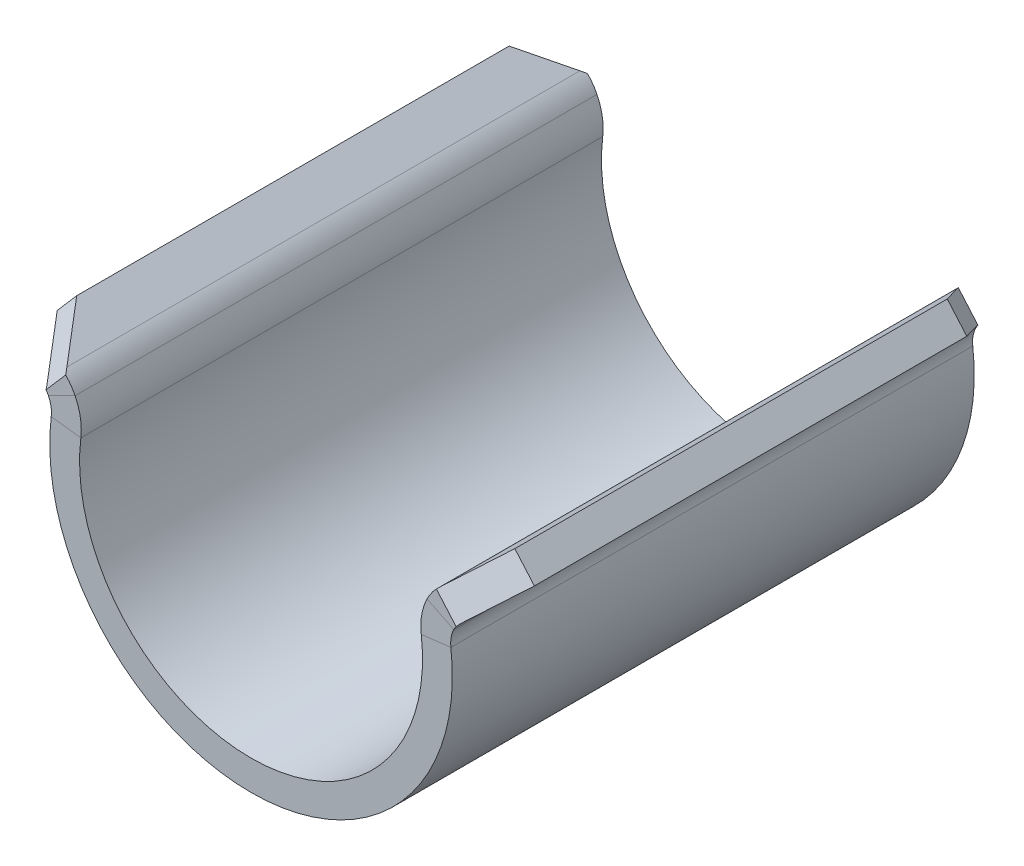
ISO-10303-21;
HEADER;
FILE_DESCRIPTION(('STEP AP214'),'2;1');
FILE_NAME('part.step','',(''),(''),'','','');
FILE_SCHEMA(('AUTOMOTIVE_DESIGN { 1 0 10303 214 1 1 1 1 }'));
ENDSEC;
DATA;
#1=APPLICATION_CONTEXT('core data for automotive mechanical design processes');
#2=APPLICATION_PROTOCOL_DEFINITION('international standard','automotive_design',2000,#1);
#3=PRODUCT_CONTEXT('',#1,'mechanical');
#4=PRODUCT('Part','Part','',(#3));
#5=PRODUCT_RELATED_PRODUCT_CATEGORY('part','',(#4));
#6=PRODUCT_DEFINITION_FORMATION('','',#4);
#7=PRODUCT_DEFINITION_CONTEXT('part definition',#1,'design');
#8=PRODUCT_DEFINITION('design','',#6,#7);
#9=PRODUCT_DEFINITION_SHAPE('','',#8);
#10=(LENGTH_UNIT() NAMED_UNIT(*) SI_UNIT(.MILLI.,.METRE.));
#11=(NAMED_UNIT(*) PLANE_ANGLE_UNIT() SI_UNIT($,.RADIAN.));
#12=(NAMED_UNIT(*) SI_UNIT($,.STERADIAN.) SOLID_ANGLE_UNIT());
#13=UNCERTAINTY_MEASURE_WITH_UNIT(LENGTH_MEASURE(1.E-05),#10,'distance_accuracy_value','');
#14=(GEOMETRIC_REPRESENTATION_CONTEXT(3) GLOBAL_UNCERTAINTY_ASSIGNED_CONTEXT((#13)) GLOBAL_UNIT_ASSIGNED_CONTEXT((#10,
#11,#12)) REPRESENTATION_CONTEXT('',''));
#15=CARTESIAN_POINT('',(0.,0.,0.));
#16=DIRECTION('',(0.,0.,1.));
#17=DIRECTION('',(1.,0.,0.));
#18=AXIS2_PLACEMENT_3D('',#15,#16,#17);
#19=CARTESIAN_POINT('',(11.4155984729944,5.64072337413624,35.));
#20=DIRECTION('',(0.,0.,1.));
#21=DIRECTION('',(1.,0.,0.));
#22=AXIS2_PLACEMENT_3D('',#19,#20,#21);
#23=PLANE('',#22);
#24=DIRECTION('',(0.992660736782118,0.120932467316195,0.));
#25=VECTOR('',#24,1.);
#26=CARTESIAN_POINT('',(11.4155984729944,5.64072337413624,35.));
#27=LINE('',#26,#25);
#28=CARTESIAN_POINT('',(11.4155984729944,5.64072337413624,35.));
#29=VERTEX_POINT('',#28);
#30=CARTESIAN_POINT('',(13.4009199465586,5.88258830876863,35.));
#31=VERTEX_POINT('',#30);
#32=EDGE_CURVE('E357',#29,#31,#27,.T.);
#33=ORIENTED_EDGE('',*,*,#32,.F.);
#34=CARTESIAN_POINT('',(0.,4.25,35.));
#35=DIRECTION('',(0.,0.,1.));
#36=DIRECTION('',(1.,0.,0.));
#37=AXIS2_PLACEMENT_3D('',#34,#35,#36);
#38=CIRCLE('',#37,11.5);
#39=CARTESIAN_POINT('',(-11.4155984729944,5.64072337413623,35.));
#40=VERTEX_POINT('',#39);
#41=EDGE_CURVE('E221',#40,#29,#38,.T.);
#42=ORIENTED_EDGE('',*,*,#41,.F.);
#43=DIRECTION('',(-0.992660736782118,0.120932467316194,0.));
#44=VECTOR('',#43,1.);
#45=CARTESIAN_POINT('',(-11.4155984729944,5.64072337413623,35.));
#46=LINE('',#45,#44);
#47=CARTESIAN_POINT('',(-13.4009199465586,5.88258830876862,35.));
#48=VERTEX_POINT('',#47);
#49=EDGE_CURVE('E351',#40,#48,#46,.T.);
#50=ORIENTED_EDGE('',*,*,#49,.T.);
#51=CARTESIAN_POINT('',(0.,4.25,35.));
#52=DIRECTION('',(0.,0.,1.));
#53=DIRECTION('',(1.,0.,0.));
#54=AXIS2_PLACEMENT_3D('',#51,#52,#53);
#55=CIRCLE('',#54,13.5);
#56=EDGE_CURVE('E242',#48,#31,#55,.T.);
#57=ORIENTED_EDGE('',*,*,#56,.T.);
#58=EDGE_LOOP('',(#33,#42,#50,#57));
#59=FACE_BOUND('',#58,.T.);
#60=ADVANCED_FACE('F44',(#59),#23,.T.);
#61=CARTESIAN_POINT('',(13.4009199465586,5.88258830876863,0.));
#62=DIRECTION('',(0.,0.,-1.));
#63=DIRECTION('',(-1.,0.,0.));
#64=AXIS2_PLACEMENT_3D('',#61,#62,#63);
#65=PLANE('',#64);
#66=DIRECTION('',(-0.992660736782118,-0.120932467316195,0.));
#67=VECTOR('',#66,1.);
#68=CARTESIAN_POINT('',(13.4009199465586,5.88258830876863,0.));
#69=LINE('',#68,#67);
#70=CARTESIAN_POINT('',(13.4009199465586,5.88258830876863,0.));
#71=VERTEX_POINT('',#70);
#72=CARTESIAN_POINT('',(11.4155984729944,5.64072337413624,0.));
#73=VERTEX_POINT('',#72);
#74=EDGE_CURVE('E354',#71,#73,#69,.T.);
#75=ORIENTED_EDGE('',*,*,#74,.F.);
#76=CARTESIAN_POINT('',(0.,4.25,0.));
#77=DIRECTION('',(0.,0.,1.));
#78=DIRECTION('',(1.,0.,0.));
#79=AXIS2_PLACEMENT_3D('',#76,#77,#78);
#80=CIRCLE('',#79,13.5);
#81=CARTESIAN_POINT('',(-13.4009199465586,5.88258830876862,0.));
#82=VERTEX_POINT('',#81);
#83=EDGE_CURVE('E274',#82,#71,#80,.T.);
#84=ORIENTED_EDGE('',*,*,#83,.F.);
#85=DIRECTION('',(0.992660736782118,-0.120932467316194,0.));
#86=VECTOR('',#85,1.);
#87=CARTESIAN_POINT('',(-13.4009199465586,5.88258830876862,0.));
#88=LINE('',#87,#86);
#89=CARTESIAN_POINT('',(-11.4155984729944,5.64072337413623,0.));
#90=VERTEX_POINT('',#89);
#91=EDGE_CURVE('E194',#82,#90,#88,.T.);
#92=ORIENTED_EDGE('',*,*,#91,.T.);
#93=CARTESIAN_POINT('',(0.,4.25,0.));
#94=DIRECTION('',(0.,0.,1.));
#95=DIRECTION('',(1.,0.,0.));
#96=AXIS2_PLACEMENT_3D('',#93,#94,#95);
#97=CIRCLE('',#96,11.5);
#98=EDGE_CURVE('E257',#90,#73,#97,.T.);
#99=ORIENTED_EDGE('',*,*,#98,.T.);
#100=EDGE_LOOP('',(#75,#84,#92,#99));
#101=FACE_BOUND('',#100,.T.);
#102=ADVANCED_FACE('F461',(#101),#65,.T.);
#103=CARTESIAN_POINT('',(-11.4155984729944,5.64072337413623,35.));
#104=DIRECTION('',(0.,0.,1.));
#105=DIRECTION('',(1.,0.,0.));
#106=AXIS2_PLACEMENT_3D('',#103,#104,#105);
#107=PLANE('',#106);
#108=ORIENTED_EDGE('',*,*,#49,.F.);
#109=CARTESIAN_POINT('',(-15.3862414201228,6.12445324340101,35.));
#110=DIRECTION('',(0.,0.,1.));
#111=DIRECTION('',(1.,0.,0.));
#112=AXIS2_PLACEMENT_3D('',#109,#110,#111);
#113=CIRCLE('',#112,4.);
#114=CARTESIAN_POINT('',(-11.7996687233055,7.89546885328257,35.));
#115=VERTEX_POINT('',#114);
#116=EDGE_CURVE('E226',#115,#40,#113,.F.);
#117=ORIENTED_EDGE('',*,*,#116,.F.);
#118=DIRECTION('',(-0.896643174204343,-0.442753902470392,0.));
#119=VECTOR('',#118,1.);
#120=CARTESIAN_POINT('',(-11.7996687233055,7.89546885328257,35.));
#121=LINE('',#120,#119);
#122=CARTESIAN_POINT('',(-13.5929550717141,7.00996104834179,35.));
#123=VERTEX_POINT('',#122);
#124=EDGE_CURVE('E343',#115,#123,#121,.T.);
#125=ORIENTED_EDGE('',*,*,#124,.T.);
#126=CARTESIAN_POINT('',(-15.3862414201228,6.12445324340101,35.));
#127=DIRECTION('',(0.,0.,-1.));
#128=DIRECTION('',(1.,0.,0.));
#129=AXIS2_PLACEMENT_3D('',#126,#127,#128);
#130=CIRCLE('',#129,2.);
#131=EDGE_CURVE('E238',#123,#48,#130,.T.);
#132=ORIENTED_EDGE('',*,*,#131,.T.);
#133=EDGE_LOOP('',(#108,#117,#125,#132));
#134=FACE_BOUND('',#133,.T.);
#135=ADVANCED_FACE('F467',(#134),#107,.T.);
#136=CARTESIAN_POINT('',(-13.4009199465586,5.88258830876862,0.));
#137=DIRECTION('',(0.,0.,-1.));
#138=DIRECTION('',(-1.,0.,0.));
#139=AXIS2_PLACEMENT_3D('',#136,#137,#138);
#140=PLANE('',#139);
#141=ORIENTED_EDGE('',*,*,#91,.F.);
#142=CARTESIAN_POINT('',(-15.3862414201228,6.12445324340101,0.));
#143=DIRECTION('',(0.,0.,-1.));
#144=DIRECTION('',(1.,0.,0.));
#145=AXIS2_PLACEMENT_3D('',#142,#143,#144);
#146=CIRCLE('',#145,2.);
#147=CARTESIAN_POINT('',(-13.5929550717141,7.00996104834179,0.));
#148=VERTEX_POINT('',#147);
#149=EDGE_CURVE('E271',#148,#82,#146,.T.);
#150=ORIENTED_EDGE('',*,*,#149,.F.);
#151=DIRECTION('',(0.896643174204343,0.442753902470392,0.));
#152=VECTOR('',#151,1.);
#153=CARTESIAN_POINT('',(-13.5929550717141,7.00996104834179,0.));
#154=LINE('',#153,#152);
#155=CARTESIAN_POINT('',(-11.7996687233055,7.89546885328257,0.));
#156=VERTEX_POINT('',#155);
#157=EDGE_CURVE('E339',#148,#156,#154,.T.);
#158=ORIENTED_EDGE('',*,*,#157,.T.);
#159=CARTESIAN_POINT('',(-15.3862414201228,6.12445324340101,0.));
#160=DIRECTION('',(0.,0.,1.));
#161=DIRECTION('',(1.,0.,0.));
#162=AXIS2_PLACEMENT_3D('',#159,#160,#161);
#163=CIRCLE('',#162,4.);
#164=EDGE_CURVE('E261',#156,#90,#163,.F.);
#165=ORIENTED_EDGE('',*,*,#164,.T.);
#166=EDGE_LOOP('',(#141,#150,#158,#165));
#167=FACE_BOUND('',#166,.T.);
#168=ADVANCED_FACE('F513',(#167),#140,.T.);
#169=CARTESIAN_POINT('',(13.5929550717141,7.0099610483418,35.));
#170=DIRECTION('',(0.,0.,1.));
#171=DIRECTION('',(1.,0.,0.));
#172=AXIS2_PLACEMENT_3D('',#169,#170,#171);
#173=PLANE('',#172);
#174=CARTESIAN_POINT('',(14.9379198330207,6.34583019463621,35.));
#175=DIRECTION('',(0.,0.,-1.));
#176=DIRECTION('',(-1.,0.,0.));
#177=AXIS2_PLACEMENT_3D('',#174,#175,#176);
#178=CIRCLE('',#177,1.5);
#179=CARTESIAN_POINT('',(13.5929550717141,7.0099610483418,35.));
#180=VERTEX_POINT('',#179);
#181=CARTESIAN_POINT('',(13.7515454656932,7.26371682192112,35.));
#182=VERTEX_POINT('',#181);
#183=EDGE_CURVE('E248',#180,#182,#178,.T.);
#184=ORIENTED_EDGE('',*,*,#183,.T.);
#185=DIRECTION('',(-0.654668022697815,0.755916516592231,0.));
#186=VECTOR('',#185,1.);
#187=CARTESIAN_POINT('',(13.809152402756,7.19720061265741,35.));
#188=LINE('',#187,#186);
#189=CARTESIAN_POINT('',(12.4311171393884,8.78835762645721,35.));
#190=VERTEX_POINT('',#189);
#191=EDGE_CURVE('E53',#182,#190,#188,.T.);
#192=ORIENTED_EDGE('',*,*,#191,.T.);
#193=CARTESIAN_POINT('',(14.9379198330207,6.34583019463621,35.));
#194=DIRECTION('',(0.,0.,1.));
#195=DIRECTION('',(1.,0.,0.));
#196=AXIS2_PLACEMENT_3D('',#193,#194,#195);
#197=CIRCLE('',#196,3.5);
#198=CARTESIAN_POINT('',(11.7996687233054,7.89546885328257,35.));
#199=VERTEX_POINT('',#198);
#200=EDGE_CURVE('E202',#199,#190,#197,.F.);
#201=ORIENTED_EDGE('',*,*,#200,.F.);
#202=DIRECTION('',(-0.896643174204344,0.442753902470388,0.));
#203=VECTOR('',#202,1.);
#204=CARTESIAN_POINT('',(13.5929550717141,7.0099610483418,35.));
#205=LINE('',#204,#203);
#206=EDGE_CURVE('E184',#180,#199,#205,.T.);
#207=ORIENTED_EDGE('',*,*,#206,.F.);
#208=EDGE_LOOP('',(#184,#192,#201,#207));
#209=FACE_BOUND('',#208,.T.);
#210=ADVANCED_FACE('F213',(#209),#173,.T.);
#211=CARTESIAN_POINT('',(12.6465817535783,8.99153800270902,35.));
#212=DIRECTION('',(0.,0.,1.));
#213=DIRECTION('',(1.,0.,0.));
#214=AXIS2_PLACEMENT_3D('',#211,#212,#213);
#215=PLANE('',#214);
#216=CARTESIAN_POINT('',(15.3862414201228,6.12445324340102,35.));
#217=DIRECTION('',(0.,0.,-1.));
#218=DIRECTION('',(-1.,0.,0.));
#219=AXIS2_PLACEMENT_3D('',#216,#217,#218);
#220=CIRCLE('',#219,2.);
#221=EDGE_CURVE('E191',#31,#180,#220,.T.);
#222=ORIENTED_EDGE('',*,*,#221,.T.);
#223=ORIENTED_EDGE('',*,*,#206,.T.);
#224=CARTESIAN_POINT('',(15.3862414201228,6.12445324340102,35.));
#225=DIRECTION('',(0.,0.,1.));
#226=DIRECTION('',(1.,0.,0.));
#227=AXIS2_PLACEMENT_3D('',#224,#225,#226);
#228=CIRCLE('',#227,4.);
#229=EDGE_CURVE('E188',#29,#199,#228,.F.);
#230=ORIENTED_EDGE('',*,*,#229,.F.);
#231=ORIENTED_EDGE('',*,*,#32,.T.);
#232=EDGE_LOOP('',(#222,#223,#230,#231));
#233=FACE_BOUND('',#232,.T.);
#234=ADVANCED_FACE('F186',(#233),#215,.T.);
#235=CARTESIAN_POINT('',(13.9559177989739,7.47970496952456,0.));
#236=DIRECTION('',(0.,0.,-1.));
#237=DIRECTION('',(-1.,0.,0.));
#238=AXIS2_PLACEMENT_3D('',#235,#236,#237);
#239=PLANE('',#238);
#240=CARTESIAN_POINT('',(14.9379198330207,6.34583019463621,0.));
#241=DIRECTION('',(0.,0.,1.));
#242=DIRECTION('',(1.,0.,0.));
#243=AXIS2_PLACEMENT_3D('',#240,#241,#242);
#244=CIRCLE('',#243,3.5);
#245=CARTESIAN_POINT('',(11.7996687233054,7.89546885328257,0.));
#246=VERTEX_POINT('',#245);
#247=CARTESIAN_POINT('',(12.4311171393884,8.78835762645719,0.));
#248=VERTEX_POINT('',#247);
#249=EDGE_CURVE('E205',#246,#248,#244,.F.);
#250=ORIENTED_EDGE('',*,*,#249,.T.);
#251=DIRECTION('',(0.654668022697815,-0.755916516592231,0.));
#252=VECTOR('',#251,1.);
#253=CARTESIAN_POINT('',(13.7322504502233,7.28599593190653,0.));
#254=LINE('',#253,#252);
#255=CARTESIAN_POINT('',(13.7515454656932,7.26371682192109,0.));
#256=VERTEX_POINT('',#255);
#257=EDGE_CURVE('E395',#248,#256,#254,.T.);
#258=ORIENTED_EDGE('',*,*,#257,.T.);
#259=CARTESIAN_POINT('',(14.9379198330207,6.34583019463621,0.));
#260=DIRECTION('',(0.,0.,-1.));
#261=DIRECTION('',(-1.,0.,0.));
#262=AXIS2_PLACEMENT_3D('',#259,#260,#261);
#263=CIRCLE('',#262,1.5);
#264=CARTESIAN_POINT('',(13.5929550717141,7.0099610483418,0.));
#265=VERTEX_POINT('',#264);
#266=EDGE_CURVE('E215',#265,#256,#263,.T.);
#267=ORIENTED_EDGE('',*,*,#266,.F.);
#268=DIRECTION('',(0.896643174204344,-0.442753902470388,0.));
#269=VECTOR('',#268,1.);
#270=CARTESIAN_POINT('',(11.7996687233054,7.89546885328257,0.));
#271=LINE('',#270,#269);
#272=EDGE_CURVE('E195',#246,#265,#271,.T.);
#273=ORIENTED_EDGE('',*,*,#272,.F.);
#274=EDGE_LOOP('',(#250,#258,#267,#273));
#275=FACE_BOUND('',#274,.T.);
#276=ADVANCED_FACE('F432',(#275),#239,.T.);
#277=CARTESIAN_POINT('',(-13.9559177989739,7.47970496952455,35.));
#278=DIRECTION('',(0.,0.,1.));
#279=DIRECTION('',(1.,0.,0.));
#280=AXIS2_PLACEMENT_3D('',#277,#278,#279);
#281=PLANE('',#280);
#282=CARTESIAN_POINT('',(-14.9379198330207,6.3458301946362,35.));
#283=DIRECTION('',(0.,0.,1.));
#284=DIRECTION('',(1.,0.,0.));
#285=AXIS2_PLACEMENT_3D('',#282,#283,#284);
#286=CIRCLE('',#285,3.5);
#287=CARTESIAN_POINT('',(-12.4311171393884,8.7883576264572,35.));
#288=VERTEX_POINT('',#287);
#289=EDGE_CURVE('E232',#288,#115,#286,.F.);
#290=ORIENTED_EDGE('',*,*,#289,.F.);
#291=DIRECTION('',(-0.654668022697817,-0.75591651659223,0.));
#292=VECTOR('',#291,1.);
#293=CARTESIAN_POINT('',(-13.7322504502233,7.28599593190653,35.));
#294=LINE('',#293,#292);
#295=CARTESIAN_POINT('',(-13.7515454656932,7.26371682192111,35.));
#296=VERTEX_POINT('',#295);
#297=EDGE_CURVE('E11',#288,#296,#294,.T.);
#298=ORIENTED_EDGE('',*,*,#297,.T.);
#299=CARTESIAN_POINT('',(-14.9379198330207,6.3458301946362,35.));
#300=DIRECTION('',(0.,0.,-1.));
#301=DIRECTION('',(-1.,0.,0.));
#302=AXIS2_PLACEMENT_3D('',#299,#300,#301);
#303=CIRCLE('',#302,1.5);
#304=EDGE_CURVE('E235',#296,#123,#303,.T.);
#305=ORIENTED_EDGE('',*,*,#304,.T.);
#306=ORIENTED_EDGE('',*,*,#124,.F.);
#307=EDGE_LOOP('',(#290,#298,#305,#306));
#308=FACE_BOUND('',#307,.T.);
#309=ADVANCED_FACE('F758',(#308),#281,.T.);
#310=CARTESIAN_POINT('',(-13.5929550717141,7.00996104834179,0.));
#311=DIRECTION('',(0.,0.,-1.));
#312=DIRECTION('',(-1.,0.,0.));
#313=AXIS2_PLACEMENT_3D('',#310,#311,#312);
#314=PLANE('',#313);
#315=CARTESIAN_POINT('',(-14.9379198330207,6.3458301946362,0.));
#316=DIRECTION('',(0.,0.,-1.));
#317=DIRECTION('',(-1.,0.,0.));
#318=AXIS2_PLACEMENT_3D('',#315,#316,#317);
#319=CIRCLE('',#318,1.5);
#320=CARTESIAN_POINT('',(-13.7515454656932,7.26371682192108,0.));
#321=VERTEX_POINT('',#320);
#322=EDGE_CURVE('E268',#321,#148,#319,.T.);
#323=ORIENTED_EDGE('',*,*,#322,.F.);
#324=DIRECTION('',(0.654668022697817,0.75591651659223,0.));
#325=VECTOR('',#324,1.);
#326=CARTESIAN_POINT('',(-13.809152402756,7.19720061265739,0.));
#327=LINE('',#326,#325);
#328=CARTESIAN_POINT('',(-12.4311171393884,8.78835762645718,0.));
#329=VERTEX_POINT('',#328);
#330=EDGE_CURVE('E360',#321,#329,#327,.T.);
#331=ORIENTED_EDGE('',*,*,#330,.T.);
#332=CARTESIAN_POINT('',(-14.9379198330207,6.3458301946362,0.));
#333=DIRECTION('',(0.,0.,1.));
#334=DIRECTION('',(1.,0.,0.));
#335=AXIS2_PLACEMENT_3D('',#332,#333,#334);
#336=CIRCLE('',#335,3.5);
#337=EDGE_CURVE('E265',#329,#156,#336,.F.);
#338=ORIENTED_EDGE('',*,*,#337,.T.);
#339=ORIENTED_EDGE('',*,*,#157,.F.);
#340=EDGE_LOOP('',(#323,#331,#338,#339));
#341=FACE_BOUND('',#340,.T.);
#342=ADVANCED_FACE('F505',(#341),#314,.T.);
#343=CARTESIAN_POINT('',(-12.6465817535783,8.99153800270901,0.));
#344=DIRECTION('',(0.,0.,-1.));
#345=DIRECTION('',(-1.,0.,0.));
#346=AXIS2_PLACEMENT_3D('',#343,#344,#345);
#347=PLANE('',#346);
#348=CARTESIAN_POINT('',(15.3862414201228,6.12445324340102,0.));
#349=DIRECTION('',(0.,0.,-1.));
#350=DIRECTION('',(-1.,0.,0.));
#351=AXIS2_PLACEMENT_3D('',#348,#349,#350);
#352=CIRCLE('',#351,2.);
#353=EDGE_CURVE('E278',#71,#265,#352,.T.);
#354=ORIENTED_EDGE('',*,*,#353,.F.);
#355=ORIENTED_EDGE('',*,*,#74,.T.);
#356=CARTESIAN_POINT('',(15.3862414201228,6.12445324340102,0.));
#357=DIRECTION('',(0.,0.,1.));
#358=DIRECTION('',(1.,0.,0.));
#359=AXIS2_PLACEMENT_3D('',#356,#357,#358);
#360=CIRCLE('',#359,4.);
#361=EDGE_CURVE('E254',#73,#246,#360,.F.);
#362=ORIENTED_EDGE('',*,*,#361,.T.);
#363=ORIENTED_EDGE('',*,*,#272,.T.);
#364=EDGE_LOOP('',(#354,#355,#362,#363));
#365=FACE_BOUND('',#364,.T.);
#366=ADVANCED_FACE('F527',(#365),#347,.T.);
#367=CARTESIAN_POINT('',(16.,9.25000000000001,35.));
#368=DIRECTION('',(-0.654668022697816,0.755916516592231,0.));
#369=DIRECTION('',(-0.755916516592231,-0.654668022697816,0.));
#370=AXIS2_PLACEMENT_3D('',#367,#368,#369);
#371=PLANE('',#370);
#372=DIRECTION('',(0.,0.,-1.));
#373=VECTOR('',#372,1.);
#374=CARTESIAN_POINT('',(13.9559177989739,7.47970496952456,35.));
#375=LINE('',#374,#373);
#376=CARTESIAN_POINT('',(13.9559177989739,7.47970496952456,34.7041110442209));
#377=VERTEX_POINT('',#376);
#378=CARTESIAN_POINT('',(13.9559177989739,7.47970496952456,0.295888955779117));
#379=VERTEX_POINT('',#378);
#380=EDGE_CURVE('E251',#377,#379,#375,.T.);
#381=ORIENTED_EDGE('',*,*,#380,.T.);
#382=DIRECTION('',(-0.534513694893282,-0.462920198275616,-0.707106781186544));
#383=VECTOR('',#382,1.);
#384=CARTESIAN_POINT('',(13.7322504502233,7.28599593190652,0.));
#385=LINE('',#384,#383);
#386=CARTESIAN_POINT('',(16.,9.25000000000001,3.00000000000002));
#387=VERTEX_POINT('',#386);
#388=EDGE_CURVE('E408',#379,#387,#385,.F.);
#389=ORIENTED_EDGE('',*,*,#388,.T.);
#390=DIRECTION('',(0.,0.,-1.));
#391=VECTOR('',#390,1.);
#392=CARTESIAN_POINT('',(16.,9.25000000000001,35.));
#393=LINE('',#392,#391);
#394=CARTESIAN_POINT('',(16.,9.25000000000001,32.));
#395=VERTEX_POINT('',#394);
#396=EDGE_CURVE('E335',#395,#387,#393,.T.);
#397=ORIENTED_EDGE('',*,*,#396,.F.);
#398=DIRECTION('',(0.534513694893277,0.462920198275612,-0.707106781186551));
#399=VECTOR('',#398,1.);
#400=CARTESIAN_POINT('',(16.,9.25000000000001,32.));
#401=LINE('',#400,#399);
#402=EDGE_CURVE('E405',#395,#377,#401,.F.);
#403=ORIENTED_EDGE('',*,*,#402,.T.);
#404=EDGE_LOOP('',(#381,#389,#397,#403));
#405=FACE_BOUND('',#404,.T.);
#406=ADVANCED_FACE('F442',(#405),#371,.F.);
#407=CARTESIAN_POINT('',(14.6906639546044,10.7618330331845,35.));
#408=DIRECTION('',(0.755916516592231,0.654668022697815,0.));
#409=DIRECTION('',(-0.654668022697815,0.755916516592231,0.));
#410=AXIS2_PLACEMENT_3D('',#407,#408,#409);
#411=PLANE('',#410);
#412=ORIENTED_EDGE('',*,*,#396,.T.);
#413=DIRECTION('',(-0.654668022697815,0.755916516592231,0.));
#414=VECTOR('',#413,1.);
#415=CARTESIAN_POINT('',(14.6906639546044,10.7618330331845,3.00000000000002));
#416=LINE('',#415,#414);
#417=CARTESIAN_POINT('',(14.6906639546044,10.7618330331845,3.00000000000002));
#418=VERTEX_POINT('',#417);
#419=EDGE_CURVE('E414',#387,#418,#416,.T.);
#420=ORIENTED_EDGE('',*,*,#419,.T.);
#421=DIRECTION('',(0.,0.,-1.));
#422=VECTOR('',#421,1.);
#423=CARTESIAN_POINT('',(14.6906639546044,10.7618330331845,35.));
#424=LINE('',#423,#422);
#425=CARTESIAN_POINT('',(14.6906639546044,10.7618330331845,32.));
#426=VERTEX_POINT('',#425);
#427=EDGE_CURVE('E332',#426,#418,#424,.T.);
#428=ORIENTED_EDGE('',*,*,#427,.F.);
#429=DIRECTION('',(0.654668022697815,-0.755916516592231,0.));
#430=VECTOR('',#429,1.);
#431=CARTESIAN_POINT('',(14.6906639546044,10.7618330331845,32.));
#432=LINE('',#431,#430);
#433=EDGE_CURVE('E410',#426,#395,#432,.T.);
#434=ORIENTED_EDGE('',*,*,#433,.T.);
#435=EDGE_LOOP('',(#412,#420,#428,#434));
#436=FACE_BOUND('',#435,.T.);
#437=ADVANCED_FACE('F450',(#436),#411,.T.);
#438=CARTESIAN_POINT('',(14.6906639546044,10.7618330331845,35.));
#439=DIRECTION('',(-0.654668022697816,0.755916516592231,0.));
#440=DIRECTION('',(-0.755916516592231,-0.654668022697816,0.));
#441=AXIS2_PLACEMENT_3D('',#438,#439,#440);
#442=PLANE('',#441);
#443=ORIENTED_EDGE('',*,*,#427,.T.);
#444=DIRECTION('',(0.534513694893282,0.462920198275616,0.707106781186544));
#445=VECTOR('',#444,1.);
#446=CARTESIAN_POINT('',(26.7853282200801,21.2365213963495,18.9999999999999));
#447=LINE('',#446,#445);
#448=CARTESIAN_POINT('',(12.6465817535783,8.99153800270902,0.295888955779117));
#449=VERTEX_POINT('',#448);
#450=EDGE_CURVE('E67',#418,#449,#447,.F.);
#451=ORIENTED_EDGE('',*,*,#450,.T.);
#452=DIRECTION('',(0.,0.,-1.));
#453=VECTOR('',#452,1.);
#454=CARTESIAN_POINT('',(12.6465817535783,8.99153800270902,35.));
#455=LINE('',#454,#453);
#456=CARTESIAN_POINT('',(12.6465817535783,8.99153800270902,34.7041110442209));
#457=VERTEX_POINT('',#456);
#458=EDGE_CURVE('E210',#457,#449,#455,.T.);
#459=ORIENTED_EDGE('',*,*,#458,.F.);
#460=DIRECTION('',(-0.534513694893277,-0.462920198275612,0.707106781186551));
#461=VECTOR('',#460,1.);
#462=CARTESIAN_POINT('',(13.556789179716,9.77983099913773,33.5));
#463=LINE('',#462,#461);
#464=EDGE_CURVE('E417',#457,#426,#463,.F.);
#465=ORIENTED_EDGE('',*,*,#464,.T.);
#466=EDGE_LOOP('',(#443,#451,#459,#465));
#467=FACE_BOUND('',#466,.T.);
#468=ADVANCED_FACE('F451',(#467),#442,.T.);
#469=CARTESIAN_POINT('',(14.9379198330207,6.34583019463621,35.));
#470=DIRECTION('',(0.,0.,-1.));
#471=DIRECTION('',(-1.,0.,0.));
#472=AXIS2_PLACEMENT_3D('',#469,#470,#471);
#473=CYLINDRICAL_SURFACE('',#472,3.5);
#474=ORIENTED_EDGE('',*,*,#458,.T.);
#475=CARTESIAN_POINT('',(14.9379198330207,6.34583019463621,0.295888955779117));
#476=DIRECTION('',(-0.534513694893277,-0.462920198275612,0.707106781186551));
#477=DIRECTION('',(-0.534513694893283,-0.462920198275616,-0.707106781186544));
#478=AXIS2_PLACEMENT_3D('',#475,#476,#477);
#479=ELLIPSE('',#478,4.94974746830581,3.5);
#480=EDGE_CURVE('E425',#449,#248,#479,.T.);
#481=ORIENTED_EDGE('',*,*,#480,.T.);
#482=ORIENTED_EDGE('',*,*,#249,.F.);
#483=DIRECTION('',(0.,0.,-1.));
#484=VECTOR('',#483,1.);
#485=CARTESIAN_POINT('',(11.7996687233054,7.89546885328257,35.));
#486=LINE('',#485,#484);
#487=EDGE_CURVE('E200',#199,#246,#486,.T.);
#488=ORIENTED_EDGE('',*,*,#487,.F.);
#489=ORIENTED_EDGE('',*,*,#200,.T.);
#490=CARTESIAN_POINT('',(14.9379198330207,6.34583019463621,34.7041110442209));
#491=DIRECTION('',(-0.534513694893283,-0.462920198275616,-0.707106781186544));
#492=DIRECTION('',(0.534513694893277,0.462920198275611,-0.707106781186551));
#493=AXIS2_PLACEMENT_3D('',#490,#491,#492);
#494=ELLIPSE('',#493,4.94974746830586,3.5);
#495=EDGE_CURVE('E422',#190,#457,#494,.T.);
#496=ORIENTED_EDGE('',*,*,#495,.T.);
#497=EDGE_LOOP('',(#474,#481,#482,#488,#489,#496));
#498=FACE_BOUND('',#497,.T.);
#499=ADVANCED_FACE('F201',(#498),#473,.T.);
#500=CARTESIAN_POINT('',(15.3862414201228,6.12445324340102,35.));
#501=DIRECTION('',(0.,0.,-1.));
#502=DIRECTION('',(-1.,0.,0.));
#503=AXIS2_PLACEMENT_3D('',#500,#501,#502);
#504=CYLINDRICAL_SURFACE('',#503,4.);
#505=ORIENTED_EDGE('',*,*,#361,.F.);
#506=DIRECTION('',(0.,0.,-1.));
#507=VECTOR('',#506,1.);
#508=CARTESIAN_POINT('',(11.4155984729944,5.64072337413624,35.));
#509=LINE('',#508,#507);
#510=EDGE_CURVE('E211',#29,#73,#509,.T.);
#511=ORIENTED_EDGE('',*,*,#510,.F.);
#512=ORIENTED_EDGE('',*,*,#229,.T.);
#513=ORIENTED_EDGE('',*,*,#487,.T.);
#514=EDGE_LOOP('',(#505,#511,#512,#513));
#515=FACE_BOUND('',#514,.T.);
#516=ADVANCED_FACE('F218',(#515),#504,.T.);
#517=CARTESIAN_POINT('',(0.,4.25,35.));
#518=DIRECTION('',(0.,0.,-1.));
#519=DIRECTION('',(-1.,0.,0.));
#520=AXIS2_PLACEMENT_3D('',#517,#518,#519);
#521=CYLINDRICAL_SURFACE('',#520,11.5);
#522=ORIENTED_EDGE('',*,*,#98,.F.);
#523=DIRECTION('',(0.,0.,-1.));
#524=VECTOR('',#523,1.);
#525=CARTESIAN_POINT('',(-11.4155984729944,5.64072337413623,35.));
#526=LINE('',#525,#524);
#527=EDGE_CURVE('E324',#40,#90,#526,.T.);
#528=ORIENTED_EDGE('',*,*,#527,.F.);
#529=ORIENTED_EDGE('',*,*,#41,.T.);
#530=ORIENTED_EDGE('',*,*,#510,.T.);
#531=EDGE_LOOP('',(#522,#528,#529,#530));
#532=FACE_BOUND('',#531,.T.);
#533=ADVANCED_FACE('F524',(#532),#521,.F.);
#534=CARTESIAN_POINT('',(-15.3862414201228,6.12445324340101,35.));
#535=DIRECTION('',(0.,0.,-1.));
#536=DIRECTION('',(-1.,0.,0.));
#537=AXIS2_PLACEMENT_3D('',#534,#535,#536);
#538=CYLINDRICAL_SURFACE('',#537,4.);
#539=ORIENTED_EDGE('',*,*,#164,.F.);
#540=DIRECTION('',(0.,0.,-1.));
#541=VECTOR('',#540,1.);
#542=CARTESIAN_POINT('',(-11.7996687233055,7.89546885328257,35.));
#543=LINE('',#542,#541);
#544=EDGE_CURVE('E320',#115,#156,#543,.T.);
#545=ORIENTED_EDGE('',*,*,#544,.F.);
#546=ORIENTED_EDGE('',*,*,#116,.T.);
#547=ORIENTED_EDGE('',*,*,#527,.T.);
#548=EDGE_LOOP('',(#539,#545,#546,#547));
#549=FACE_BOUND('',#548,.T.);
#550=ADVANCED_FACE('F519',(#549),#538,.T.);
#551=CARTESIAN_POINT('',(-14.9379198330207,6.3458301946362,35.));
#552=DIRECTION('',(0.,0.,-1.));
#553=DIRECTION('',(-1.,0.,0.));
#554=AXIS2_PLACEMENT_3D('',#551,#552,#553);
#555=CYLINDRICAL_SURFACE('',#554,3.5);
#556=ORIENTED_EDGE('',*,*,#337,.F.);
#557=CARTESIAN_POINT('',(-14.9379198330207,6.3458301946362,0.29588895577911));
#558=DIRECTION('',(0.534513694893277,-0.462920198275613,0.707106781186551));
#559=DIRECTION('',(0.534513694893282,-0.462920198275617,-0.707106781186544));
#560=AXIS2_PLACEMENT_3D('',#557,#558,#559);
#561=ELLIPSE('',#560,4.94974746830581,3.5);
#562=CARTESIAN_POINT('',(-12.6465817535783,8.99153800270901,0.29588895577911));
#563=VERTEX_POINT('',#562);
#564=EDGE_CURVE('E367',#329,#563,#561,.T.);
#565=ORIENTED_EDGE('',*,*,#564,.T.);
#566=DIRECTION('',(0.,0.,-1.));
#567=VECTOR('',#566,1.);
#568=CARTESIAN_POINT('',(-12.6465817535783,8.99153800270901,35.));
#569=LINE('',#568,#567);
#570=CARTESIAN_POINT('',(-12.6465817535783,8.99153800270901,34.7041110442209));
#571=VERTEX_POINT('',#570);
#572=EDGE_CURVE('E316',#571,#563,#569,.T.);
#573=ORIENTED_EDGE('',*,*,#572,.F.);
#574=CARTESIAN_POINT('',(-14.9379198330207,6.3458301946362,34.7041110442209));
#575=DIRECTION('',(0.534513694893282,-0.462920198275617,-0.707106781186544));
#576=DIRECTION('',(-0.534513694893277,0.462920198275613,-0.707106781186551));
#577=AXIS2_PLACEMENT_3D('',#574,#575,#576);
#578=ELLIPSE('',#577,4.94974746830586,3.5);
#579=EDGE_CURVE('E364',#571,#288,#578,.T.);
#580=ORIENTED_EDGE('',*,*,#579,.T.);
#581=ORIENTED_EDGE('',*,*,#289,.T.);
#582=ORIENTED_EDGE('',*,*,#544,.T.);
#583=EDGE_LOOP('',(#556,#565,#573,#580,#581,#582));
#584=FACE_BOUND('',#583,.T.);
#585=ADVANCED_FACE('F557',(#584),#555,.T.);
#586=CARTESIAN_POINT('',(-14.6906639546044,10.7618330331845,35.));
#587=DIRECTION('',(0.654668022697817,0.75591651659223,0.));
#588=DIRECTION('',(-0.75591651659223,0.654668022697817,0.));
#589=AXIS2_PLACEMENT_3D('',#586,#587,#588);
#590=PLANE('',#589);
#591=ORIENTED_EDGE('',*,*,#572,.T.);
#592=DIRECTION('',(0.534513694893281,-0.462920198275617,-0.707106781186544));
#593=VECTOR('',#592,1.);
#594=CARTESIAN_POINT('',(-26.78532822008,21.2365213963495,18.9999999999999));
#595=LINE('',#594,#593);
#596=CARTESIAN_POINT('',(-14.6906639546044,10.7618330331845,3.00000000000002));
#597=VERTEX_POINT('',#596);
#598=EDGE_CURVE('E373',#563,#597,#595,.F.);
#599=ORIENTED_EDGE('',*,*,#598,.T.);
#600=DIRECTION('',(0.,0.,-1.));
#601=VECTOR('',#600,1.);
#602=CARTESIAN_POINT('',(-14.6906639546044,10.7618330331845,35.));
#603=LINE('',#602,#601);
#604=CARTESIAN_POINT('',(-14.6906639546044,10.7618330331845,32.));
#605=VERTEX_POINT('',#604);
#606=EDGE_CURVE('E312',#605,#597,#603,.T.);
#607=ORIENTED_EDGE('',*,*,#606,.F.);
#608=DIRECTION('',(-0.534513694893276,0.462920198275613,-0.707106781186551));
#609=VECTOR('',#608,1.);
#610=CARTESIAN_POINT('',(-13.556789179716,9.77983099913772,33.5));
#611=LINE('',#610,#609);
#612=EDGE_CURVE('E370',#605,#571,#611,.F.);
#613=ORIENTED_EDGE('',*,*,#612,.T.);
#614=EDGE_LOOP('',(#591,#599,#607,#613));
#615=FACE_BOUND('',#614,.T.);
#616=ADVANCED_FACE('F553',(#615),#590,.T.);
#617=CARTESIAN_POINT('',(-16.,9.25,35.));
#618=DIRECTION('',(-0.75591651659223,0.654668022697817,0.));
#619=DIRECTION('',(-0.654668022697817,-0.75591651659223,0.));
#620=AXIS2_PLACEMENT_3D('',#617,#618,#619);
#621=PLANE('',#620);
#622=ORIENTED_EDGE('',*,*,#606,.T.);
#623=DIRECTION('',(-0.654668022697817,-0.75591651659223,0.));
#624=VECTOR('',#623,1.);
#625=CARTESIAN_POINT('',(-16.,9.25,3.00000000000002));
#626=LINE('',#625,#624);
#627=CARTESIAN_POINT('',(-16.,9.25,3.00000000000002));
#628=VERTEX_POINT('',#627);
#629=EDGE_CURVE('E380',#597,#628,#626,.T.);
#630=ORIENTED_EDGE('',*,*,#629,.T.);
#631=DIRECTION('',(0.,0.,-1.));
#632=VECTOR('',#631,1.);
#633=CARTESIAN_POINT('',(-16.,9.25,35.));
#634=LINE('',#633,#632);
#635=CARTESIAN_POINT('',(-16.,9.25,32.));
#636=VERTEX_POINT('',#635);
#637=EDGE_CURVE('E308',#636,#628,#634,.T.);
#638=ORIENTED_EDGE('',*,*,#637,.F.);
#639=DIRECTION('',(0.654668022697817,0.75591651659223,0.));
#640=VECTOR('',#639,1.);
#641=CARTESIAN_POINT('',(-16.,9.25,32.));
#642=LINE('',#641,#640);
#643=EDGE_CURVE('E376',#636,#605,#642,.T.);
#644=ORIENTED_EDGE('',*,*,#643,.T.);
#645=EDGE_LOOP('',(#622,#630,#638,#644));
#646=FACE_BOUND('',#645,.T.);
#647=ADVANCED_FACE('F550',(#646),#621,.T.);
#648=CARTESIAN_POINT('',(-16.,9.25,35.));
#649=DIRECTION('',(0.654668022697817,0.75591651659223,0.));
#650=DIRECTION('',(-0.75591651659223,0.654668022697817,0.));
#651=AXIS2_PLACEMENT_3D('',#648,#649,#650);
#652=PLANE('',#651);
#653=ORIENTED_EDGE('',*,*,#637,.T.);
#654=DIRECTION('',(-0.534513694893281,0.462920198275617,0.707106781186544));
#655=VECTOR('',#654,1.);
#656=CARTESIAN_POINT('',(-13.7322504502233,7.28599593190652,0.));
#657=LINE('',#656,#655);
#658=CARTESIAN_POINT('',(-13.9559177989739,7.47970496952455,0.29588895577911));
#659=VERTEX_POINT('',#658);
#660=EDGE_CURVE('E386',#628,#659,#657,.F.);
#661=ORIENTED_EDGE('',*,*,#660,.T.);
#662=DIRECTION('',(0.,0.,-1.));
#663=VECTOR('',#662,1.);
#664=CARTESIAN_POINT('',(-13.9559177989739,7.47970496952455,35.));
#665=LINE('',#664,#663);
#666=CARTESIAN_POINT('',(-13.9559177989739,7.47970496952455,34.7041110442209));
#667=VERTEX_POINT('',#666);
#668=EDGE_CURVE('E304',#667,#659,#665,.T.);
#669=ORIENTED_EDGE('',*,*,#668,.F.);
#670=DIRECTION('',(0.534513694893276,-0.462920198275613,0.707106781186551));
#671=VECTOR('',#670,1.);
#672=CARTESIAN_POINT('',(-16.,9.25,32.));
#673=LINE('',#672,#671);
#674=EDGE_CURVE('E383',#667,#636,#673,.F.);
#675=ORIENTED_EDGE('',*,*,#674,.T.);
#676=EDGE_LOOP('',(#653,#661,#669,#675));
#677=FACE_BOUND('',#676,.T.);
#678=ADVANCED_FACE('F496',(#677),#652,.F.);
#679=CARTESIAN_POINT('',(-14.9379198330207,6.3458301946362,35.));
#680=DIRECTION('',(0.,0.,-1.));
#681=DIRECTION('',(-1.,0.,0.));
#682=AXIS2_PLACEMENT_3D('',#679,#680,#681);
#683=CYLINDRICAL_SURFACE('',#682,1.5);
#684=ORIENTED_EDGE('',*,*,#668,.T.);
#685=CARTESIAN_POINT('',(-14.9379198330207,6.3458301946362,0.29588895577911));
#686=DIRECTION('',(0.534513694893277,-0.462920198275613,0.707106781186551));
#687=DIRECTION('',(0.534513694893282,-0.462920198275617,-0.707106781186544));
#688=AXIS2_PLACEMENT_3D('',#685,#686,#687);
#689=ELLIPSE('',#688,2.12132034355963,1.5);
#690=EDGE_CURVE('E392',#659,#321,#689,.F.);
#691=ORIENTED_EDGE('',*,*,#690,.T.);
#692=ORIENTED_EDGE('',*,*,#322,.T.);
#693=DIRECTION('',(0.,0.,-1.));
#694=VECTOR('',#693,1.);
#695=CARTESIAN_POINT('',(-13.5929550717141,7.00996104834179,35.));
#696=LINE('',#695,#694);
#697=EDGE_CURVE('E300',#123,#148,#696,.T.);
#698=ORIENTED_EDGE('',*,*,#697,.F.);
#699=ORIENTED_EDGE('',*,*,#304,.F.);
#700=CARTESIAN_POINT('',(-14.9379198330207,6.3458301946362,34.7041110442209));
#701=DIRECTION('',(0.534513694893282,-0.462920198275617,-0.707106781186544));
#702=DIRECTION('',(-0.534513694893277,0.462920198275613,-0.707106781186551));
#703=AXIS2_PLACEMENT_3D('',#700,#701,#702);
#704=ELLIPSE('',#703,2.12132034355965,1.5);
#705=EDGE_CURVE('E389',#296,#667,#704,.F.);
#706=ORIENTED_EDGE('',*,*,#705,.T.);
#707=EDGE_LOOP('',(#684,#691,#692,#698,#699,#706));
#708=FACE_BOUND('',#707,.T.);
#709=ADVANCED_FACE('F492',(#708),#683,.F.);
#710=CARTESIAN_POINT('',(-15.3862414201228,6.12445324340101,35.));
#711=DIRECTION('',(0.,0.,-1.));
#712=DIRECTION('',(-1.,0.,0.));
#713=AXIS2_PLACEMENT_3D('',#710,#711,#712);
#714=CYLINDRICAL_SURFACE('',#713,2.);
#715=ORIENTED_EDGE('',*,*,#149,.T.);
#716=DIRECTION('',(0.,0.,-1.));
#717=VECTOR('',#716,1.);
#718=CARTESIAN_POINT('',(-13.4009199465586,5.88258830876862,35.));
#719=LINE('',#718,#717);
#720=EDGE_CURVE('E296',#48,#82,#719,.T.);
#721=ORIENTED_EDGE('',*,*,#720,.F.);
#722=ORIENTED_EDGE('',*,*,#131,.F.);
#723=ORIENTED_EDGE('',*,*,#697,.T.);
#724=EDGE_LOOP('',(#715,#721,#722,#723));
#725=FACE_BOUND('',#724,.T.);
#726=ADVANCED_FACE('F511',(#725),#714,.F.);
#727=CARTESIAN_POINT('',(0.,4.25,35.));
#728=DIRECTION('',(0.,0.,-1.));
#729=DIRECTION('',(-1.,0.,0.));
#730=AXIS2_PLACEMENT_3D('',#727,#728,#729);
#731=CYLINDRICAL_SURFACE('',#730,13.5);
#732=ORIENTED_EDGE('',*,*,#83,.T.);
#733=DIRECTION('',(0.,0.,-1.));
#734=VECTOR('',#733,1.);
#735=CARTESIAN_POINT('',(13.4009199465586,5.88258830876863,35.));
#736=LINE('',#735,#734);
#737=EDGE_CURVE('E292',#31,#71,#736,.T.);
#738=ORIENTED_EDGE('',*,*,#737,.F.);
#739=ORIENTED_EDGE('',*,*,#56,.F.);
#740=ORIENTED_EDGE('',*,*,#720,.T.);
#741=EDGE_LOOP('',(#732,#738,#739,#740));
#742=FACE_BOUND('',#741,.T.);
#743=ADVANCED_FACE('F530',(#742),#731,.T.);
#744=CARTESIAN_POINT('',(15.3862414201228,6.12445324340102,35.));
#745=DIRECTION('',(0.,0.,-1.));
#746=DIRECTION('',(-1.,0.,0.));
#747=AXIS2_PLACEMENT_3D('',#744,#745,#746);
#748=CYLINDRICAL_SURFACE('',#747,2.);
#749=ORIENTED_EDGE('',*,*,#353,.T.);
#750=DIRECTION('',(0.,0.,-1.));
#751=VECTOR('',#750,1.);
#752=CARTESIAN_POINT('',(13.5929550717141,7.0099610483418,35.));
#753=LINE('',#752,#751);
#754=EDGE_CURVE('E288',#180,#265,#753,.T.);
#755=ORIENTED_EDGE('',*,*,#754,.F.);
#756=ORIENTED_EDGE('',*,*,#221,.F.);
#757=ORIENTED_EDGE('',*,*,#737,.T.);
#758=EDGE_LOOP('',(#749,#755,#756,#757));
#759=FACE_BOUND('',#758,.T.);
#760=ADVANCED_FACE('F533',(#759),#748,.F.);
#761=CARTESIAN_POINT('',(14.9379198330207,6.34583019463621,35.));
#762=DIRECTION('',(0.,0.,-1.));
#763=DIRECTION('',(-1.,0.,0.));
#764=AXIS2_PLACEMENT_3D('',#761,#762,#763);
#765=CYLINDRICAL_SURFACE('',#764,1.5);
#766=ORIENTED_EDGE('',*,*,#266,.T.);
#767=CARTESIAN_POINT('',(14.9379198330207,6.34583019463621,0.295888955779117));
#768=DIRECTION('',(-0.534513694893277,-0.462920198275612,0.707106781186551));
#769=DIRECTION('',(-0.534513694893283,-0.462920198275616,-0.707106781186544));
#770=AXIS2_PLACEMENT_3D('',#767,#768,#769);
#771=ELLIPSE('',#770,2.12132034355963,1.5);
#772=EDGE_CURVE('E402',#256,#379,#771,.F.);
#773=ORIENTED_EDGE('',*,*,#772,.T.);
#774=ORIENTED_EDGE('',*,*,#380,.F.);
#775=CARTESIAN_POINT('',(14.9379198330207,6.34583019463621,34.7041110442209));
#776=DIRECTION('',(-0.534513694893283,-0.462920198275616,-0.707106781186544));
#777=DIRECTION('',(0.534513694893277,0.462920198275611,-0.707106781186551));
#778=AXIS2_PLACEMENT_3D('',#775,#776,#777);
#779=ELLIPSE('',#778,2.12132034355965,1.5);
#780=EDGE_CURVE('E399',#377,#182,#779,.F.);
#781=ORIENTED_EDGE('',*,*,#780,.T.);
#782=ORIENTED_EDGE('',*,*,#183,.F.);
#783=ORIENTED_EDGE('',*,*,#754,.T.);
#784=EDGE_LOOP('',(#766,#773,#774,#781,#782,#783));
#785=FACE_BOUND('',#784,.T.);
#786=ADVANCED_FACE('F439',(#785),#765,.F.);
#787=CARTESIAN_POINT('',(-13.809152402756,7.19720061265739,0.));
#788=DIRECTION('',(0.534513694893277,-0.462920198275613,0.707106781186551));
#789=DIRECTION('',(0.654668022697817,0.75591651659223,0.));
#790=AXIS2_PLACEMENT_3D('',#787,#788,#789);
#791=PLANE('',#790);
#792=ORIENTED_EDGE('',*,*,#660,.F.);
#793=ORIENTED_EDGE('',*,*,#629,.F.);
#794=ORIENTED_EDGE('',*,*,#598,.F.);
#795=ORIENTED_EDGE('',*,*,#564,.F.);
#796=ORIENTED_EDGE('',*,*,#330,.F.);
#797=ORIENTED_EDGE('',*,*,#690,.F.);
#798=EDGE_LOOP('',(#792,#793,#794,#795,#796,#797));
#799=FACE_BOUND('',#798,.T.);
#800=ADVANCED_FACE('F472',(#799),#791,.F.);
#801=CARTESIAN_POINT('',(13.7322504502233,7.28599593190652,0.));
#802=DIRECTION('',(-0.534513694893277,-0.462920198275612,0.707106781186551));
#803=DIRECTION('',(0.654668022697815,-0.755916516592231,0.));
#804=AXIS2_PLACEMENT_3D('',#801,#802,#803);
#805=PLANE('',#804);
#806=ORIENTED_EDGE('',*,*,#450,.F.);
#807=ORIENTED_EDGE('',*,*,#419,.F.);
#808=ORIENTED_EDGE('',*,*,#388,.F.);
#809=ORIENTED_EDGE('',*,*,#772,.F.);
#810=ORIENTED_EDGE('',*,*,#257,.F.);
#811=ORIENTED_EDGE('',*,*,#480,.F.);
#812=EDGE_LOOP('',(#806,#807,#808,#809,#810,#811));
#813=FACE_BOUND('',#812,.T.);
#814=ADVANCED_FACE('F434',(#813),#805,.F.);
#815=CARTESIAN_POINT('',(14.6906639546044,10.7618330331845,32.));
#816=DIRECTION('',(-0.534513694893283,-0.462920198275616,-0.707106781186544));
#817=DIRECTION('',(0.654668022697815,-0.755916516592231,0.));
#818=AXIS2_PLACEMENT_3D('',#815,#816,#817);
#819=PLANE('',#818);
#820=ORIENTED_EDGE('',*,*,#495,.F.);
#821=ORIENTED_EDGE('',*,*,#191,.F.);
#822=ORIENTED_EDGE('',*,*,#780,.F.);
#823=ORIENTED_EDGE('',*,*,#402,.F.);
#824=ORIENTED_EDGE('',*,*,#433,.F.);
#825=ORIENTED_EDGE('',*,*,#464,.F.);
#826=EDGE_LOOP('',(#820,#821,#822,#823,#824,#825));
#827=FACE_BOUND('',#826,.T.);
#828=ADVANCED_FACE('F446',(#827),#819,.F.);
#829=CARTESIAN_POINT('',(-16.,9.25,32.));
#830=DIRECTION('',(0.534513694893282,-0.462920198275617,-0.707106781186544));
#831=DIRECTION('',(0.654668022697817,0.75591651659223,0.));
#832=AXIS2_PLACEMENT_3D('',#829,#830,#831);
#833=PLANE('',#832);
#834=ORIENTED_EDGE('',*,*,#705,.F.);
#835=ORIENTED_EDGE('',*,*,#297,.F.);
#836=ORIENTED_EDGE('',*,*,#579,.F.);
#837=ORIENTED_EDGE('',*,*,#612,.F.);
#838=ORIENTED_EDGE('',*,*,#643,.F.);
#839=ORIENTED_EDGE('',*,*,#674,.F.);
#840=EDGE_LOOP('',(#834,#835,#836,#837,#838,#839));
#841=FACE_BOUND('',#840,.T.);
#842=ADVANCED_FACE('F46',(#841),#833,.F.);
#843=CLOSED_SHELL('',(#60,#102,#135,#168,#210,#234,#276,#309,#342,#366,#406,#437,#468,#499,#516,
#533,#550,#585,#616,#647,#678,#709,#726,#743,#760,#786,#800,#814,#828,#842));
#844=MANIFOLD_SOLID_BREP('B2',#843);
#845=ADVANCED_BREP_SHAPE_REPRESENTATION('',(#18,#844),#14);
#846=SHAPE_DEFINITION_REPRESENTATION(#9,#845);
ENDSEC;
END-ISO-10303-21;
